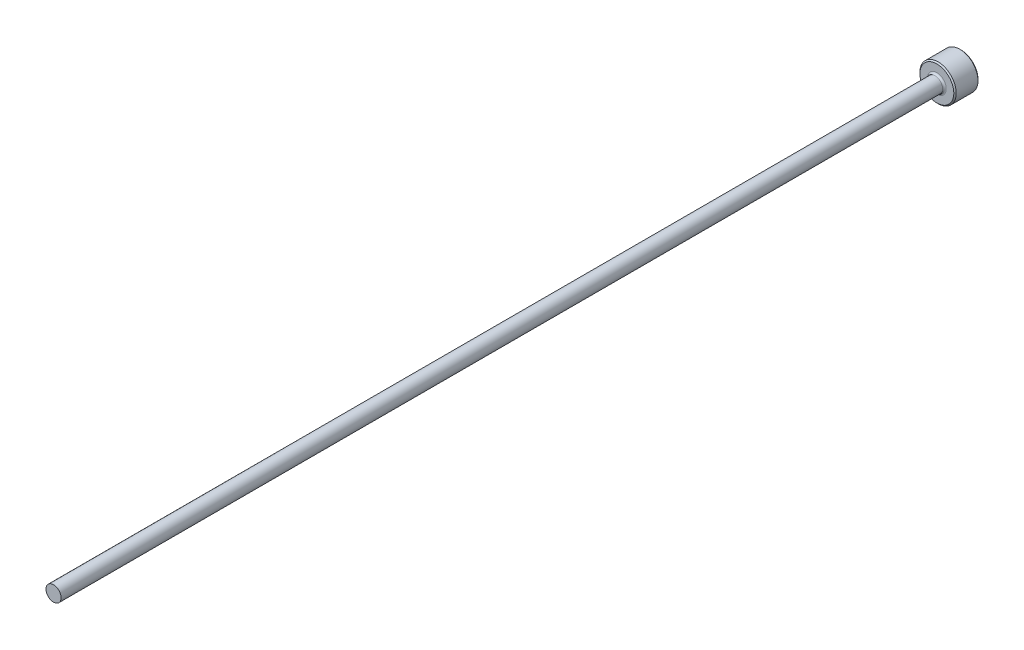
ISO-10303-21;
HEADER;
FILE_DESCRIPTION(('STEP AP214'),'2;1');
FILE_NAME('part.step','',(''),(''),'','','');
FILE_SCHEMA(('AUTOMOTIVE_DESIGN { 1 0 10303 214 1 1 1 1 }'));
ENDSEC;
DATA;
#1=APPLICATION_CONTEXT('core data for automotive mechanical design processes');
#2=APPLICATION_PROTOCOL_DEFINITION('international standard','automotive_design',2000,#1);
#3=PRODUCT_CONTEXT('',#1,'mechanical');
#4=PRODUCT('Part','Part','',(#3));
#5=PRODUCT_RELATED_PRODUCT_CATEGORY('part','',(#4));
#6=PRODUCT_DEFINITION_FORMATION('','',#4);
#7=PRODUCT_DEFINITION_CONTEXT('part definition',#1,'design');
#8=PRODUCT_DEFINITION('design','',#6,#7);
#9=PRODUCT_DEFINITION_SHAPE('','',#8);
#10=(LENGTH_UNIT() NAMED_UNIT(*) SI_UNIT(.MILLI.,.METRE.));
#11=(NAMED_UNIT(*) PLANE_ANGLE_UNIT() SI_UNIT($,.RADIAN.));
#12=(NAMED_UNIT(*) SI_UNIT($,.STERADIAN.) SOLID_ANGLE_UNIT());
#13=UNCERTAINTY_MEASURE_WITH_UNIT(LENGTH_MEASURE(1.E-05),#10,'distance_accuracy_value','');
#14=(GEOMETRIC_REPRESENTATION_CONTEXT(3) GLOBAL_UNCERTAINTY_ASSIGNED_CONTEXT((#13)) GLOBAL_UNIT_ASSIGNED_CONTEXT((#10,
#11,#12)) REPRESENTATION_CONTEXT('',''));
#15=CARTESIAN_POINT('',(0.,0.,0.));
#16=DIRECTION('',(0.,0.,1.));
#17=DIRECTION('',(1.,0.,0.));
#18=AXIS2_PLACEMENT_3D('',#15,#16,#17);
#19=CARTESIAN_POINT('',(0.,1.24999999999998,150.));
#20=DIRECTION('',(0.,0.,-1.));
#21=DIRECTION('',(-1.,0.,0.));
#22=AXIS2_PLACEMENT_3D('',#19,#20,#21);
#23=PLANE('',#22);
#24=CARTESIAN_POINT('',(0.,0.,150.));
#25=DIRECTION('',(0.,0.,1.));
#26=DIRECTION('',(1.,0.,0.));
#27=AXIS2_PLACEMENT_3D('',#24,#25,#26);
#28=CIRCLE('',#27,1.24999999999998);
#29=CARTESIAN_POINT('',(1.24999999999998,0.,150.));
#30=VERTEX_POINT('',#29);
#31=EDGE_CURVE('E50',#30,#30,#28,.T.);
#32=ORIENTED_EDGE('',*,*,#31,.T.);
#33=EDGE_LOOP('',(#32));
#34=FACE_BOUND('',#33,.T.);
#35=ADVANCED_FACE('F30',(#34),#23,.F.);
#36=CARTESIAN_POINT('',(0.,0.,109.050628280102));
#37=DIRECTION('',(0.,0.,1.));
#38=DIRECTION('',(1.,0.,0.));
#39=AXIS2_PLACEMENT_3D('',#36,#37,#38);
#40=CYLINDRICAL_SURFACE('',#39,1.24999999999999);
#41=ORIENTED_EDGE('',*,*,#31,.F.);
#42=EDGE_LOOP('',(#41));
#43=FACE_BOUND('',#42,.T.);
#44=CARTESIAN_POINT('',(0.,0.,4.3));
#45=DIRECTION('',(0.,0.,1.));
#46=DIRECTION('',(1.,0.,0.));
#47=AXIS2_PLACEMENT_3D('',#44,#45,#46);
#48=CIRCLE('',#47,1.25);
#49=CARTESIAN_POINT('',(1.25,0.,4.3));
#50=VERTEX_POINT('',#49);
#51=EDGE_CURVE('E53',#50,#50,#48,.T.);
#52=ORIENTED_EDGE('',*,*,#51,.T.);
#53=EDGE_LOOP('',(#52));
#54=FACE_BOUND('',#53,.T.);
#55=ADVANCED_FACE('F73',(#43,#54),#40,.T.);
#56=CARTESIAN_POINT('',(0.,0.,4.3));
#57=DIRECTION('',(0.,0.,1.));
#58=DIRECTION('',(1.,0.,0.));
#59=AXIS2_PLACEMENT_3D('',#56,#57,#58);
#60=TOROIDAL_SURFACE('',#59,1.55,0.3);
#61=ORIENTED_EDGE('',*,*,#51,.F.);
#62=EDGE_LOOP('',(#61));
#63=FACE_BOUND('',#62,.T.);
#64=CARTESIAN_POINT('',(0.,0.,4.));
#65=DIRECTION('',(0.,0.,1.));
#66=DIRECTION('',(1.,0.,0.));
#67=AXIS2_PLACEMENT_3D('',#64,#65,#66);
#68=CIRCLE('',#67,1.55);
#69=CARTESIAN_POINT('',(1.55,0.,4.));
#70=VERTEX_POINT('',#69);
#71=EDGE_CURVE('E56',#70,#70,#68,.T.);
#72=ORIENTED_EDGE('',*,*,#71,.T.);
#73=EDGE_LOOP('',(#72));
#74=FACE_BOUND('',#73,.T.);
#75=ADVANCED_FACE('F60',(#63,#74),#60,.F.);
#76=CARTESIAN_POINT('',(0.,3.,4.));
#77=DIRECTION('',(0.,0.,-1.));
#78=DIRECTION('',(-1.,0.,0.));
#79=AXIS2_PLACEMENT_3D('',#76,#77,#78);
#80=PLANE('',#79);
#81=CARTESIAN_POINT('',(0.,0.,4.));
#82=DIRECTION('',(0.,0.,-1.));
#83=DIRECTION('',(-1.,0.,0.));
#84=AXIS2_PLACEMENT_3D('',#81,#82,#83);
#85=CIRCLE('',#84,2.80000000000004);
#86=CARTESIAN_POINT('',(-2.80000000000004,0.,4.));
#87=VERTEX_POINT('',#86);
#88=EDGE_CURVE('E10',#87,#87,#85,.F.);
#89=ORIENTED_EDGE('',*,*,#88,.T.);
#90=EDGE_LOOP('',(#89));
#91=FACE_BOUND('',#90,.T.);
#92=ORIENTED_EDGE('',*,*,#71,.F.);
#93=EDGE_LOOP('',(#92));
#94=FACE_BOUND('',#93,.T.);
#95=ADVANCED_FACE('F62',(#91,#94),#80,.F.);
#96=CARTESIAN_POINT('',(0.,0.,109.050628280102));
#97=DIRECTION('',(0.,0.,1.));
#98=DIRECTION('',(1.,0.,0.));
#99=AXIS2_PLACEMENT_3D('',#96,#97,#98);
#100=CYLINDRICAL_SURFACE('',#99,3.);
#101=CARTESIAN_POINT('',(0.,0.,0.20000000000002));
#102=DIRECTION('',(0.,0.,1.));
#103=DIRECTION('',(1.,0.,0.));
#104=AXIS2_PLACEMENT_3D('',#101,#102,#103);
#105=CIRCLE('',#104,3.);
#106=CARTESIAN_POINT('',(3.,0.,0.20000000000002));
#107=VERTEX_POINT('',#106);
#108=EDGE_CURVE('E41',#107,#107,#105,.T.);
#109=ORIENTED_EDGE('',*,*,#108,.T.);
#110=EDGE_LOOP('',(#109));
#111=FACE_BOUND('',#110,.T.);
#112=CARTESIAN_POINT('',(0.,0.,3.80000000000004));
#113=DIRECTION('',(0.,0.,-1.));
#114=DIRECTION('',(-1.,0.,0.));
#115=AXIS2_PLACEMENT_3D('',#112,#113,#114);
#116=CIRCLE('',#115,3.);
#117=CARTESIAN_POINT('',(-3.,0.,3.80000000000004));
#118=VERTEX_POINT('',#117);
#119=EDGE_CURVE('E45',#118,#118,#116,.T.);
#120=ORIENTED_EDGE('',*,*,#119,.T.);
#121=EDGE_LOOP('',(#120));
#122=FACE_BOUND('',#121,.T.);
#123=ADVANCED_FACE('F64',(#111,#122),#100,.T.);
#124=CARTESIAN_POINT('',(0.,0.,0.));
#125=DIRECTION('',(0.,0.,1.));
#126=DIRECTION('',(1.,0.,0.));
#127=AXIS2_PLACEMENT_3D('',#124,#125,#126);
#128=PLANE('',#127);
#129=CARTESIAN_POINT('',(0.,0.,0.));
#130=DIRECTION('',(0.,0.,1.));
#131=DIRECTION('',(1.,0.,0.));
#132=AXIS2_PLACEMENT_3D('',#129,#130,#131);
#133=CIRCLE('',#132,2.79999999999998);
#134=CARTESIAN_POINT('',(2.79999999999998,0.,0.));
#135=VERTEX_POINT('',#134);
#136=EDGE_CURVE('E37',#135,#135,#133,.F.);
#137=ORIENTED_EDGE('',*,*,#136,.T.);
#138=EDGE_LOOP('',(#137));
#139=FACE_BOUND('',#138,.T.);
#140=ADVANCED_FACE('F70',(#139),#128,.F.);
#141=CARTESIAN_POINT('',(0.,0.,0.20000000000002));
#142=DIRECTION('',(0.,0.,1.));
#143=DIRECTION('',(1.,0.,0.));
#144=AXIS2_PLACEMENT_3D('',#141,#142,#143);
#145=CONICAL_SURFACE('',#144,3.,0.785398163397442);
#146=ORIENTED_EDGE('',*,*,#136,.F.);
#147=EDGE_LOOP('',(#146));
#148=FACE_BOUND('',#147,.T.);
#149=ORIENTED_EDGE('',*,*,#108,.F.);
#150=EDGE_LOOP('',(#149));
#151=FACE_BOUND('',#150,.T.);
#152=ADVANCED_FACE('F84',(#148,#151),#145,.T.);
#153=CARTESIAN_POINT('',(0.,0.,4.));
#154=DIRECTION('',(0.,0.,-1.));
#155=DIRECTION('',(-1.,0.,0.));
#156=AXIS2_PLACEMENT_3D('',#153,#154,#155);
#157=CONICAL_SURFACE('',#156,2.80000000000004,0.785398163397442);
#158=ORIENTED_EDGE('',*,*,#119,.F.);
#159=EDGE_LOOP('',(#158));
#160=FACE_BOUND('',#159,.T.);
#161=ORIENTED_EDGE('',*,*,#88,.F.);
#162=EDGE_LOOP('',(#161));
#163=FACE_BOUND('',#162,.T.);
#164=ADVANCED_FACE('F32',(#160,#163),#157,.T.);
#165=CLOSED_SHELL('',(#35,#55,#75,#95,#123,#140,#152,#164));
#166=MANIFOLD_SOLID_BREP('B2',#165);
#167=ADVANCED_BREP_SHAPE_REPRESENTATION('',(#18,#166),#14);
#168=SHAPE_DEFINITION_REPRESENTATION(#9,#167);
ENDSEC;
END-ISO-10303-21;
